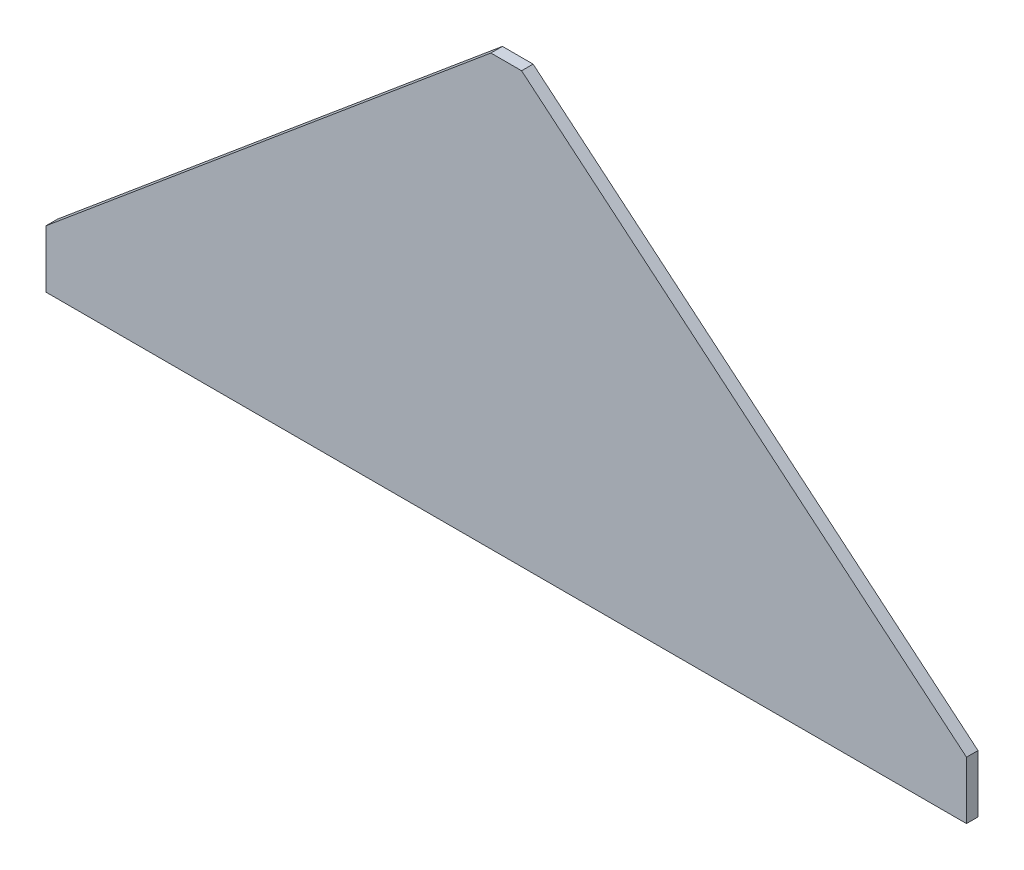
from build123d import *

# Parameters (mm, degrees)
ESQUISSE1_W             = 240
ESQUISSE1_H             = 112
EXTRUSION1_DEPTH        = 3
ENL_V_MAT_EXTRU_1_DEPTH = 3


with BuildPart() as part:
    # Esquisse1 → Extrusion1 (new body)
    with BuildSketch(Plane.XY):
        with Locations((120, 56)):
            Rectangle(ESQUISSE1_W, ESQUISSE1_H)
    extrude(amount=EXTRUSION1_DEPTH)

    # Esquisse2 → Enl_v. mat.-Extru.1 (cut)
    with BuildSketch(Plane.XY.offset(3)):
        Polygon((0, 15), (116, 112), (0, 112), align=None)
        Polygon((240, 15), (124, 112), (240, 112), align=None)
    extrude(amount=-ENL_V_MAT_EXTRU_1_DEPTH, mode=Mode.SUBTRACT)


solid = part.part
